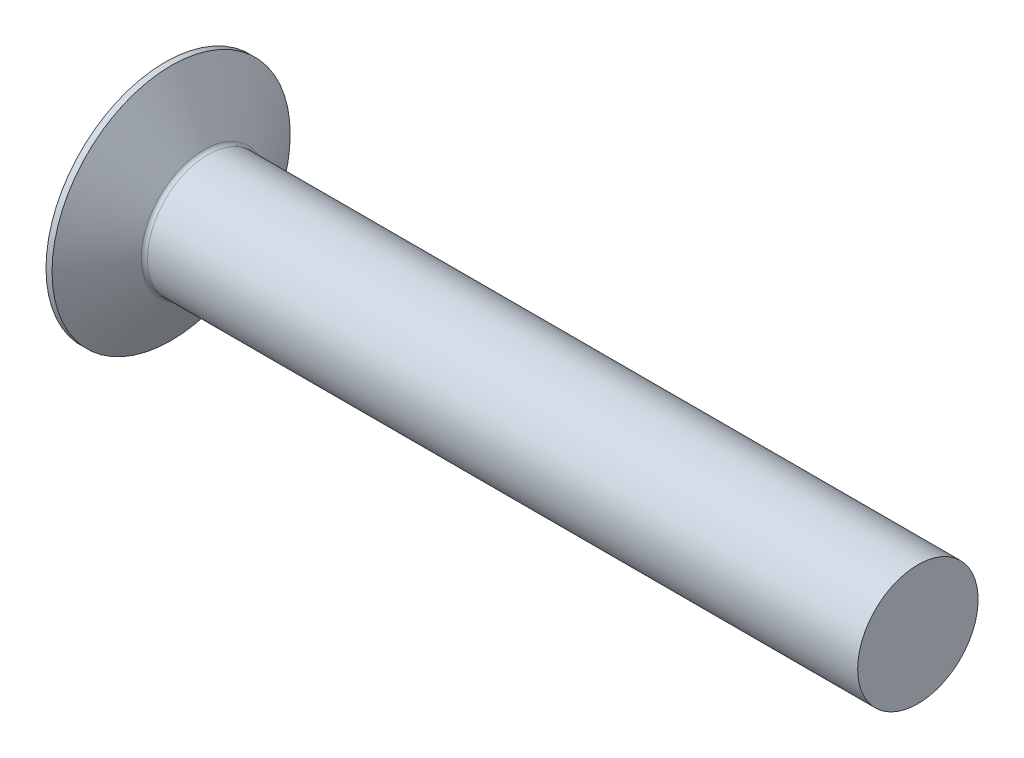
from build123d import *


with BuildPart() as part:
    # Sketch1 → Base-Revolve (revolve)
    with BuildSketch(Plane.XY, mode=Mode.PRIVATE) as base_revolve_sk:
        with BuildLine():
            Line((50, 0), (50, 4))
            Line((50, 4), (2.830644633, 4))
            ThreePointArc((2.830644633, 4), (2.680644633, 4.040192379), (2.570837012, 4.15))
            Line((2.570837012, 4.15), (0.4, 7.91))
            Line((0.4, 7.91), (0, 7.91))
            Line((0, 7.91), (0, 0))
            Line((0, 0), (50, 0))
        make_face()
    revolve(base_revolve_sk.sketch.rotate(Axis((-69.069553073, 0, 0), (1, 0, 0)), 90), axis=Axis((-69.069553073, 0, 0), (1, 0, 0)))


solid = part.part
